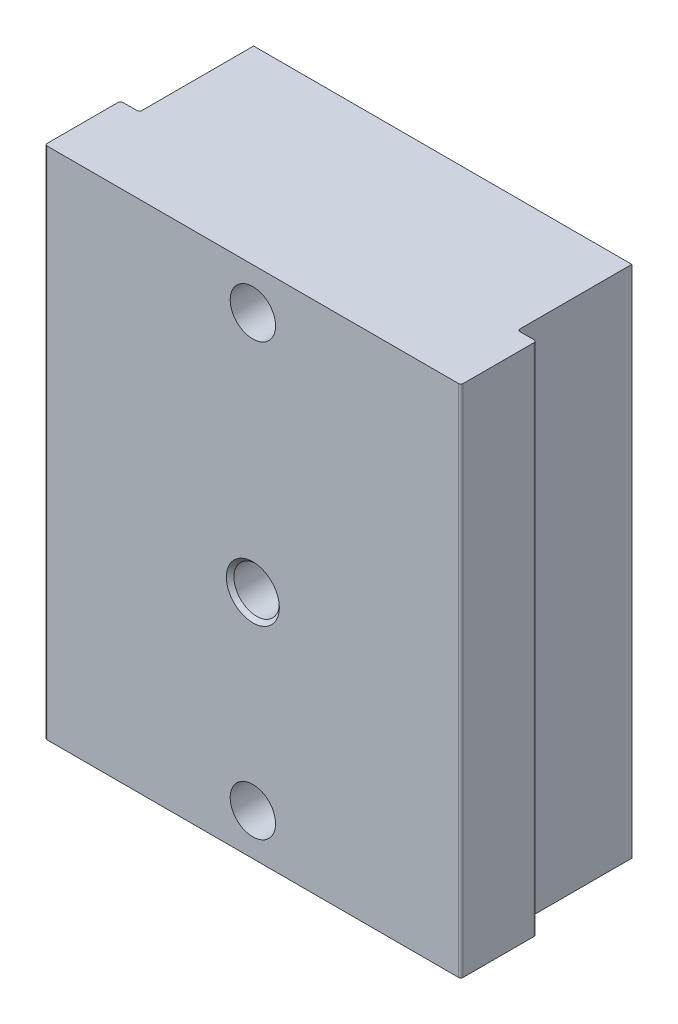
from build123d import *

# Parameters (mm, degrees)
SECTION_PROFIL_DEPTH    = 68
CONG_1_R                = 0.3
ESQUISSE3_R             = 3
ENL_V_MAT_EXTRU_1_DEPTH = 78.525866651
ESQUISSE5_R             = 1.5
ENL_V_MAT_EXTRU_3_DEPTH = 78.525866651
ESQUISSE6_R             = 3
ENL_V_MAT_EXTRU_4_DEPTH = 10
CHANFREIN1_SIZE         = 0.5


with BuildPart() as part:
    # Esquisse1 → section profil (new body)
    with BuildSketch(Plane(origin=(0, 0, 0), x_dir=(1, 0, 0), z_dir=(0, 1, 0))):
        Polygon((-25, 25.1), (25, 25.1), (25, 10), (27.5, 10), (27.5, 0), (-27.5, 0), (-27.5, 10), (-25, 10), align=None)
    extrude(amount=SECTION_PROFIL_DEPTH)

    # Cong_1
    cong_1_edges = [part.edges().sort_by_distance(p)[0] for p in [
        (27.5, 34, 0),
        (-27.5, 34, 0),
        (-27.5, 34, -10),
        (-25, 34, -10),
        (25, 34, -10),
        (27.5, 34, -10),
    ]]
    fillet(cong_1_edges, radius=CONG_1_R)

    # Esquisse3 → Enl_v. mat.-Extru.1 (cut, through all)
    with BuildSketch(Plane(origin=(0, 0, -25.1), x_dir=(-1, 0, 0), z_dir=(0, 0, -1))):
        with Locations((0, 62.5)):
            Circle(ESQUISSE3_R)
        with Locations((0, 5.5)):
            Circle(ESQUISSE3_R)
    extrude(amount=-ENL_V_MAT_EXTRU_1_DEPTH, mode=Mode.SUBTRACT)

    # Esquisse5 → Enl_v. mat.-Extru.3 (cut, through all)
    with BuildSketch(Plane(origin=(0, 0, -25.1), x_dir=(-1, 0, 0), z_dir=(0, 0, -1))):
        with Locations((0, 30.5)):
            Circle(ESQUISSE5_R)
    extrude(amount=-ENL_V_MAT_EXTRU_3_DEPTH, mode=Mode.SUBTRACT)

    # Esquisse6 → Enl_v. mat.-Extru.4 (cut)
    with BuildSketch(Plane.XY):
        with Locations((0, 30.5)):
            Circle(ESQUISSE6_R)
    extrude(amount=-ENL_V_MAT_EXTRU_4_DEPTH, mode=Mode.SUBTRACT)

    # Chanfrein1
    chanfrein1_edges = [part.edges().sort_by_distance(p)[0] for p in [
        (-3, 30.5, 0),
    ]]
    chamfer(chanfrein1_edges, length=CHANFREIN1_SIZE)


solid = part.part
